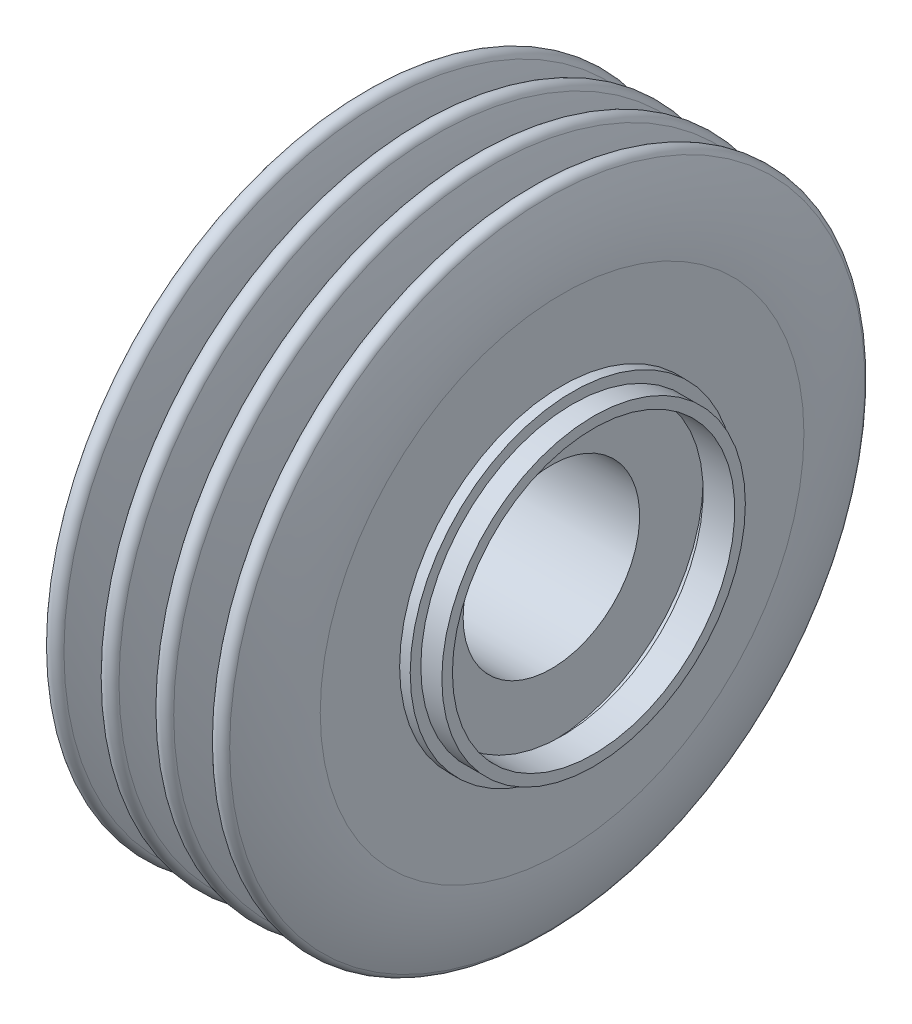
from build123d import *


with BuildPart() as part:
    # Esquisse1 → R_volution1 (revolve)
    with BuildSketch(Plane.XY, mode=Mode.PRIVATE) as r_volution1_sk:
        with BuildLine():
            Line((20.601379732, 48), (14.601379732, 48))
            Line((14.601379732, 48), (14.601379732, 46))
            Line((14.601379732, 46), (7.601379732, 46))
            Line((7.601379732, 46), (7.601379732, 43))
            Line((7.601379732, 43), (17.601379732, 43))
            Line((17.601379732, 43), (17.601379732, 45))
            Line((17.601379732, 45), (20.601379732, 45))
            Line((20.601379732, 45), (20.601379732, 25))
            Line((20.601379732, 25), (79.151379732, 25))
            Line((79.151379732, 25), (79.151379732, 43))
            Line((79.151379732, 43), (82.151379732, 43))
            Line((82.151379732, 43), (82.151379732, 40))
            Line((82.151379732, 40), (91.111379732, 40))
            Line((91.111379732, 40), (91.111379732, 43))
            Line((91.111379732, 43), (85.151379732, 43))
            Line((85.151379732, 43), (85.151379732, 46))
            Line((85.151379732, 46), (82.151379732, 46))
            Line((82.151379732, 46), (82.183550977, 68.519575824))
            ThreePointArc((82.183550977, 68.519575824), (81.129915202, 79.455793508), (77.984651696, 89.982821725))
            ThreePointArc((77.984651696, 89.982821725), (75.547981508, 91.535197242), (73.274264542, 89.752659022))
            ThreePointArc((73.274264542, 89.752659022), (70.548301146, 79.158334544), (68.634442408, 68.387645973))
            ThreePointArc((68.634442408, 68.387645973), (67.660602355, 67.559850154), (66.727440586, 68.433245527))
            ThreePointArc((66.727440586, 68.433245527), (65.051803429, 79.302640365), (62.025475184, 89.875853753))
            ThreePointArc((62.025475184, 89.875853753), (59.805934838, 91.534477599), (57.419405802, 90.126687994))
            ThreePointArc((57.419405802, 90.126687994), (53.458028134, 79.556456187), (51.495730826, 68.440175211))
            ThreePointArc((51.495730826, 68.440175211), (50.588441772, 67.560848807), (49.595544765, 68.342221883))
            ThreePointArc((49.595544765, 68.342221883), (49.580972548, 68.458379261), (49.580647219, 68.575446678))
            ThreePointArc((49.580647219, 68.575446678), (49.125098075, 79.381365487), (46.524178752, 89.87949032))
            ThreePointArc((46.524178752, 89.87949032), (44.263396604, 91.536430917), (41.885200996, 90.052930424))
            ThreePointArc((41.885200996, 90.052930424), (38.349330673, 79.505344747), (36.858254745, 68.481251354))
            ThreePointArc((36.858254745, 68.481251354), (35.876484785, 67.559840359), (34.939043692, 68.526315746))
            ThreePointArc((34.939043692, 68.526315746), (33.984038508, 79.421740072), (31.000108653, 89.944024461))
            ThreePointArc((31.000108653, 89.944024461), (28.75126817, 91.536854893), (26.403669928, 90.093534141))
            ThreePointArc((26.403669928, 90.093534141), (22.740349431, 79.566891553), (21.261520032, 68.519575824))
            Line((21.261520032, 68.519575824), (20.601379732, 48))
        make_face()
    revolve(r_volution1_sk.sketch.rotate(Axis((0, 0, 0), (1, 0, 0)), 90), axis=Axis((0, 0, 0), (1, 0, 0)))


solid = part.part
